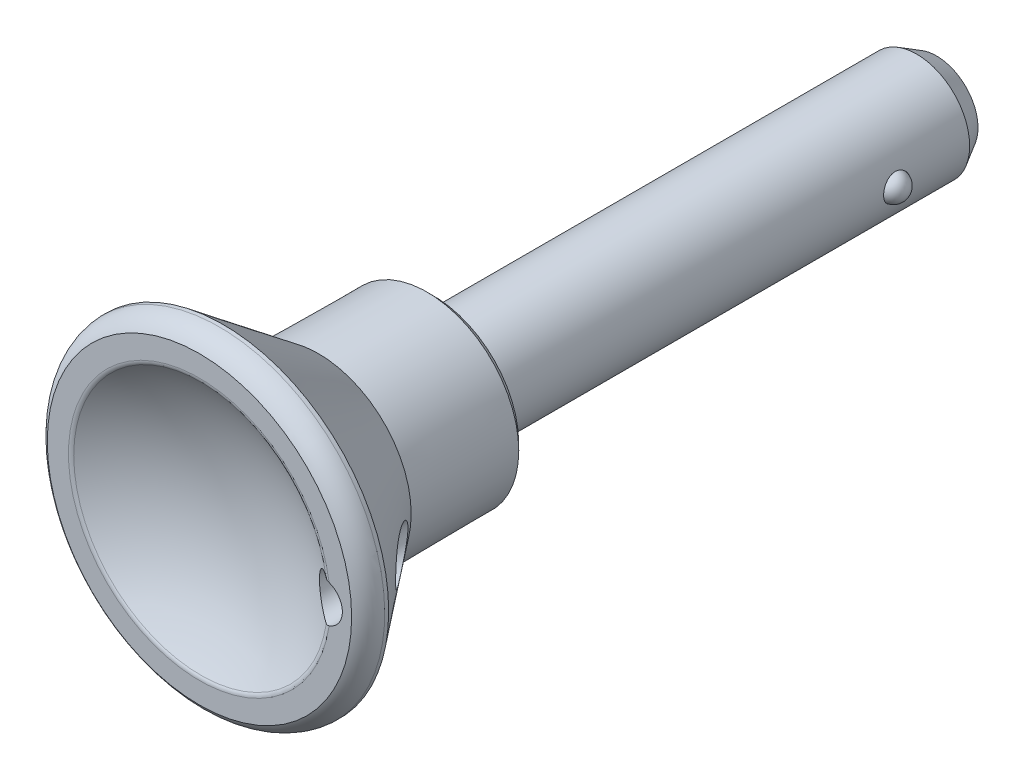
ISO-10303-21;
HEADER;
FILE_DESCRIPTION(('STEP AP214'),'2;1');
FILE_NAME('part.step','',(''),(''),'','','');
FILE_SCHEMA(('AUTOMOTIVE_DESIGN { 1 0 10303 214 1 1 1 1 }'));
ENDSEC;
DATA;
#1=APPLICATION_CONTEXT('core data for automotive mechanical design processes');
#2=APPLICATION_PROTOCOL_DEFINITION('international standard','automotive_design',2000,#1);
#3=PRODUCT_CONTEXT('',#1,'mechanical');
#4=PRODUCT('Part','Part','',(#3));
#5=PRODUCT_RELATED_PRODUCT_CATEGORY('part','',(#4));
#6=PRODUCT_DEFINITION_FORMATION('','',#4);
#7=PRODUCT_DEFINITION_CONTEXT('part definition',#1,'design');
#8=PRODUCT_DEFINITION('design','',#6,#7);
#9=PRODUCT_DEFINITION_SHAPE('','',#8);
#10=(LENGTH_UNIT() NAMED_UNIT(*) SI_UNIT(.MILLI.,.METRE.));
#11=(NAMED_UNIT(*) PLANE_ANGLE_UNIT() SI_UNIT($,.RADIAN.));
#12=(NAMED_UNIT(*) SI_UNIT($,.STERADIAN.) SOLID_ANGLE_UNIT());
#13=UNCERTAINTY_MEASURE_WITH_UNIT(LENGTH_MEASURE(1.E-05),#10,'distance_accuracy_value','');
#14=(GEOMETRIC_REPRESENTATION_CONTEXT(3) GLOBAL_UNCERTAINTY_ASSIGNED_CONTEXT((#13)) GLOBAL_UNIT_ASSIGNED_CONTEXT((#10,
#11,#12)) REPRESENTATION_CONTEXT('',''));
#15=CARTESIAN_POINT('',(0.,0.,0.));
#16=DIRECTION('',(0.,0.,1.));
#17=DIRECTION('',(1.,0.,0.));
#18=AXIS2_PLACEMENT_3D('',#15,#16,#17);
#19=CARTESIAN_POINT('',(0.,0.,0.));
#20=DIRECTION('',(0.,0.,1.));
#21=DIRECTION('',(0.,-1.,0.));
#22=AXIS2_PLACEMENT_3D('',#19,#20,#21);
#23=CYLINDRICAL_SURFACE('',#22,4.);
#24=CARTESIAN_POINT('',(0.,0.,0.));
#25=DIRECTION('',(0.,0.,1.));
#26=DIRECTION('',(0.,-1.,0.));
#27=AXIS2_PLACEMENT_3D('',#24,#25,#26);
#28=CIRCLE('',#27,4.);
#29=CARTESIAN_POINT('',(0.,-4.,0.));
#30=VERTEX_POINT('',#29);
#31=EDGE_CURVE('E17',#30,#30,#28,.T.);
#32=ORIENTED_EDGE('',*,*,#31,.F.);
#33=EDGE_LOOP('',(#32));
#34=FACE_BOUND('',#33,.T.);
#35=CARTESIAN_POINT('',(0.,0.,-36.5));
#36=DIRECTION('',(0.,0.,1.));
#37=DIRECTION('',(1.,0.,0.));
#38=AXIS2_PLACEMENT_3D('',#35,#36,#37);
#39=CIRCLE('',#38,4.);
#40=CARTESIAN_POINT('',(4.,0.,-36.5));
#41=VERTEX_POINT('',#40);
#42=EDGE_CURVE('E111',#41,#41,#39,.T.);
#43=ORIENTED_EDGE('',*,*,#42,.T.);
#44=EDGE_LOOP('',(#43));
#45=FACE_BOUND('',#44,.T.);
#46=CARTESIAN_POINT('',(3.88177455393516,0.965311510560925,-30.7388991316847));
#47=CARTESIAN_POINT('',(3.87947589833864,0.974537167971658,-30.7717537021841));
#48=CARTESIAN_POINT('',(3.87758596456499,0.982015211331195,-30.8051052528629));
#49=CARTESIAN_POINT('',(3.87470673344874,0.993322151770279,-30.8719408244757));
#50=CARTESIAN_POINT('',(3.8737042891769,0.997204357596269,-30.9054152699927));
#51=CARTESIAN_POINT('',(3.87228725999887,1.00270077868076,-30.9925132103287));
#52=CARTESIAN_POINT('',(3.87257020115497,1.00161876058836,-31.0463531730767));
#53=CARTESIAN_POINT('',(3.87471439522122,0.99327385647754,-31.1269570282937));
#54=CARTESIAN_POINT('',(3.87573945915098,0.989279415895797,-31.1541316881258));
#55=CARTESIAN_POINT('',(3.87834788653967,0.979001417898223,-31.2080101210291));
#56=CARTESIAN_POINT('',(3.87993110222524,0.972718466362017,-31.2347140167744));
#57=CARTESIAN_POINT('',(3.88177455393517,0.965311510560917,-31.2611008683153));
#58=B_SPLINE_CURVE_WITH_KNOTS('',3,(#46,#47,#48,#49,#50,#51,#52,#53,#54,#55,#56,#57),
.UNSPECIFIED.,.F.,.F.,(4,2,2,2,2,4),(0.,0.102513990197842,0.20348266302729,0.36412191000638,
0.446491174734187,0.528838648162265),.UNSPECIFIED.);
#59=CARTESIAN_POINT('',(3.88177451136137,0.96531168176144,-30.7388997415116));
#60=VERTEX_POINT('',#59);
#61=CARTESIAN_POINT('',(3.88177446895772,0.965311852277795,-31.2610996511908));
#62=VERTEX_POINT('',#61);
#63=EDGE_CURVE('E69',#60,#62,#58,.T.);
#64=ORIENTED_EDGE('',*,*,#63,.T.);
#65=CARTESIAN_POINT('',(3.88177448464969,0.965311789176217,-31.2610998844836));
#66=CARTESIAN_POINT('',(3.88540385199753,0.950638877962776,-31.3155094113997));
#67=CARTESIAN_POINT('',(3.89014046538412,0.931319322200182,-31.3685420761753));
#68=CARTESIAN_POINT('',(3.90112983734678,0.884199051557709,-31.4704413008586));
#69=CARTESIAN_POINT('',(3.90738045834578,0.856410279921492,-31.5193136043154));
#70=CARTESIAN_POINT('',(3.92071189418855,0.793126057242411,-31.6116284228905));
#71=CARTESIAN_POINT('',(3.92779250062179,0.757632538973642,-31.6550722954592));
#72=CARTESIAN_POINT('',(3.94199278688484,0.67989295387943,-31.7354385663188));
#73=CARTESIAN_POINT('',(3.94911247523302,0.637645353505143,-31.7723594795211));
#74=CARTESIAN_POINT('',(3.96270366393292,0.54690757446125,-31.8391103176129));
#75=CARTESIAN_POINT('',(3.96916547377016,0.498343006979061,-31.8688412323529));
#76=CARTESIAN_POINT('',(3.9806028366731,0.396745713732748,-31.9196822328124));
#77=CARTESIAN_POINT('',(3.98557913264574,0.34371523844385,-31.9407966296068));
#78=CARTESIAN_POINT('',(3.99291972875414,0.242471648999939,-31.9713879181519));
#79=CARTESIAN_POINT('',(3.99555479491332,0.194645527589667,-31.9820925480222));
#80=CARTESIAN_POINT('',(3.99909511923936,0.0978826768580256,-31.9963986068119));
#81=CARTESIAN_POINT('',(4.00000061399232,0.0489461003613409,-32.0000010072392));
#82=CARTESIAN_POINT('',(3.99999930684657,-0.0552566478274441,-31.999998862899));
#83=CARTESIAN_POINT('',(3.99884379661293,-0.110525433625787,-31.9954052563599));
#84=CARTESIAN_POINT('',(3.99434700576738,-0.219475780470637,-31.9771816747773));
#85=CARTESIAN_POINT('',(3.9910047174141,-0.273156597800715,-31.9635475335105));
#86=CARTESIAN_POINT('',(3.98250420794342,-0.377347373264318,-31.9277072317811));
#87=CARTESIAN_POINT('',(3.97734807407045,-0.427860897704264,-31.9055109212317));
#88=CARTESIAN_POINT('',(3.96576893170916,-0.524447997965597,-31.8532124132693));
#89=CARTESIAN_POINT('',(3.95934587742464,-0.570521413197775,-31.8231099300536));
#90=CARTESIAN_POINT('',(3.94578204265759,-0.6578732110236,-31.7551953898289));
#91=CARTESIAN_POINT('',(3.93863012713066,-0.699046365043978,-31.7172502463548));
#92=CARTESIAN_POINT('',(3.92448848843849,-0.774509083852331,-31.6350198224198));
#93=CARTESIAN_POINT('',(3.91749874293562,-0.808799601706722,-31.5907354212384));
#94=CARTESIAN_POINT('',(3.90495270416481,-0.86728421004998,-31.5004846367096));
#95=CARTESIAN_POINT('',(3.8993282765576,-0.892041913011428,-31.4548922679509));
#96=CARTESIAN_POINT('',(3.88941506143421,-0.934286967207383,-31.3602904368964));
#97=CARTESIAN_POINT('',(3.88512710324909,-0.951769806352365,-31.3112788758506));
#98=CARTESIAN_POINT('',(3.88177448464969,-0.965311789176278,-31.2610998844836));
#99=B_SPLINE_CURVE_WITH_KNOTS('',3,(#65,#66,#67,#68,#69,#70,#71,#72,#73,#74,#75,#76,#77,#78,#79,
#80,#81,#82,#83,#84,#85,#86,#87,#88,#89,#90,#91,#92,#93,#94,#95,#96,#97,#98),.UNSPECIFIED.,.F.,
.F.,(4,2,2,2,2,2,2,2,2,2,2,2,2,2,2,2,4),(0.,0.169132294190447,0.338027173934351,
0.506879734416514,0.675770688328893,0.846869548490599,1.01788269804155,1.16458276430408,
1.31126276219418,1.47685399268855,1.6425215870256,1.80799916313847,1.97348272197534,
2.1420468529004,2.31058762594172,2.46651284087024,2.62253462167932),.UNSPECIFIED.);
#100=CARTESIAN_POINT('',(3.88177451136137,-0.965311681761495,-31.2611002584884));
#101=VERTEX_POINT('',#100);
#102=EDGE_CURVE('E55',#62,#101,#99,.T.);
#103=ORIENTED_EDGE('',*,*,#102,.T.);
#104=CARTESIAN_POINT('',(3.88177455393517,-0.96531151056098,-31.2611008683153));
#105=CARTESIAN_POINT('',(3.87947589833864,-0.974537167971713,-31.2282462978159));
#106=CARTESIAN_POINT('',(3.87758596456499,-0.982015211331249,-31.1948947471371));
#107=CARTESIAN_POINT('',(3.87470673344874,-0.993322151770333,-31.1280591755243));
#108=CARTESIAN_POINT('',(3.8737042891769,-0.997204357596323,-31.0945847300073));
#109=CARTESIAN_POINT('',(3.87228725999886,-1.00270077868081,-31.0074867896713));
#110=CARTESIAN_POINT('',(3.87257020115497,-1.00161876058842,-30.9536468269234));
#111=CARTESIAN_POINT('',(3.87471439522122,-0.993273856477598,-30.8730429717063));
#112=CARTESIAN_POINT('',(3.87573945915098,-0.989279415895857,-30.8458683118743));
#113=CARTESIAN_POINT('',(3.87834788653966,-0.979001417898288,-30.791989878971));
#114=CARTESIAN_POINT('',(3.87993110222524,-0.972718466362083,-30.7652859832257));
#115=CARTESIAN_POINT('',(3.88177455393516,-0.965311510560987,-30.7388991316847));
#116=B_SPLINE_CURVE_WITH_KNOTS('',3,(#104,#105,#106,#107,#108,#109,#110,#111,#112,#113,#114,
#115),.UNSPECIFIED.,.F.,.F.,(4,2,2,2,2,4),(0.,0.102513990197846,0.203482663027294,
0.36412191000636,0.446491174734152,0.528838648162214),.UNSPECIFIED.);
#117=CARTESIAN_POINT('',(3.88177446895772,-0.965311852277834,-30.7389003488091));
#118=VERTEX_POINT('',#117);
#119=EDGE_CURVE('E62',#101,#118,#116,.T.);
#120=ORIENTED_EDGE('',*,*,#119,.T.);
#121=CARTESIAN_POINT('',(3.88177448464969,-0.965311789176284,-30.7389001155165));
#122=CARTESIAN_POINT('',(3.88540385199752,-0.950638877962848,-30.6844905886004));
#123=CARTESIAN_POINT('',(3.89014046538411,-0.931319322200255,-30.6314579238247));
#124=CARTESIAN_POINT('',(3.90112983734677,-0.884199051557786,-30.5295586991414));
#125=CARTESIAN_POINT('',(3.90738045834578,-0.856410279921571,-30.4806863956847));
#126=CARTESIAN_POINT('',(3.92071189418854,-0.7931260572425,-30.3883715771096));
#127=CARTESIAN_POINT('',(3.92779250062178,-0.757632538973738,-30.3449277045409));
#128=CARTESIAN_POINT('',(3.94199278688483,-0.679892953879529,-30.2645614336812));
#129=CARTESIAN_POINT('',(3.94911247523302,-0.637645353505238,-30.2276405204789));
#130=CARTESIAN_POINT('',(3.96270366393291,-0.546907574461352,-30.1608896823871));
#131=CARTESIAN_POINT('',(3.96916547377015,-0.498343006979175,-30.1311587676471));
#132=CARTESIAN_POINT('',(3.98060283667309,-0.396745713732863,-30.0803177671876));
#133=CARTESIAN_POINT('',(3.98557913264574,-0.343715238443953,-30.0592033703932));
#134=CARTESIAN_POINT('',(3.99291972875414,-0.242471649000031,-30.0286120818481));
#135=CARTESIAN_POINT('',(3.99555479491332,-0.194645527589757,-30.0179074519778));
#136=CARTESIAN_POINT('',(3.99909511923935,-0.097882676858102,-30.0036013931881));
#137=CARTESIAN_POINT('',(4.00000061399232,-0.0489461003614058,-29.9999989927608));
#138=CARTESIAN_POINT('',(3.99999930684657,0.0552566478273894,-30.000001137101));
#139=CARTESIAN_POINT('',(3.99884379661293,0.110525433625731,-30.0045947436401));
#140=CARTESIAN_POINT('',(3.99434700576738,0.21947578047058,-30.0228183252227));
#141=CARTESIAN_POINT('',(3.9910047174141,0.273156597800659,-30.0364524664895));
#142=CARTESIAN_POINT('',(3.98250420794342,0.377347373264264,-30.0722927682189));
#143=CARTESIAN_POINT('',(3.97734807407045,0.42786089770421,-30.0944890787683));
#144=CARTESIAN_POINT('',(3.96576893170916,0.524447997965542,-30.1467875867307));
#145=CARTESIAN_POINT('',(3.95934587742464,0.570521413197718,-30.1768900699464));
#146=CARTESIAN_POINT('',(3.94578204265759,0.657873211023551,-30.2448046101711));
#147=CARTESIAN_POINT('',(3.93863012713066,0.699046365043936,-30.2827497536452));
#148=CARTESIAN_POINT('',(3.92448848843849,0.774509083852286,-30.3649801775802));
#149=CARTESIAN_POINT('',(3.91749874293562,0.808799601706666,-30.4092645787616));
#150=CARTESIAN_POINT('',(3.90495270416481,0.867284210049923,-30.4995153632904));
#151=CARTESIAN_POINT('',(3.8993282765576,0.892041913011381,-30.5451077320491));
#152=CARTESIAN_POINT('',(3.8894150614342,0.934286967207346,-30.6397095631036));
#153=CARTESIAN_POINT('',(3.88512710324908,0.951769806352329,-30.6887211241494));
#154=CARTESIAN_POINT('',(3.88177448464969,0.965311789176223,-30.7389001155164));
#155=B_SPLINE_CURVE_WITH_KNOTS('',3,(#121,#122,#123,#124,#125,#126,#127,#128,#129,#130,#131,
#132,#133,#134,#135,#136,#137,#138,#139,#140,#141,#142,#143,#144,#145,#146,#147,#148,#149,#150,
#151,#152,#153,#154),.UNSPECIFIED.,.F.,.F.,(4,2,2,2,2,2,2,2,2,2,2,2,2,2,2,2,4),(0.,
0.169132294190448,0.338027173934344,0.506879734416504,0.675770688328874,0.84686954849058,
1.01788269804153,1.16458276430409,1.31126276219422,1.47685399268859,1.64252158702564,
1.80799916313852,1.97348272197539,2.14204685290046,2.3105876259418,2.46651284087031,
2.62253462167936),.UNSPECIFIED.);
#156=EDGE_CURVE('E67',#118,#60,#155,.T.);
#157=ORIENTED_EDGE('',*,*,#156,.T.);
#158=EDGE_LOOP('',(#64,#103,#120,#157));
#159=FACE_BOUND('',#158,.T.);
#160=ADVANCED_FACE('F14',(#34,#45,#159),#23,.T.);
#161=CARTESIAN_POINT('',(6.4240762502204,-6.50116727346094,0.));
#162=DIRECTION('',(0.,0.,-1.));
#163=DIRECTION('',(-1.,0.,0.));
#164=AXIS2_PLACEMENT_3D('',#161,#162,#163);
#165=PLANE('',#164);
#166=ORIENTED_EDGE('',*,*,#31,.T.);
#167=EDGE_LOOP('',(#166));
#168=FACE_BOUND('',#167,.T.);
#169=CARTESIAN_POINT('',(0.,0.,0.));
#170=DIRECTION('',(0.,0.,1.));
#171=DIRECTION('',(0.,-1.,0.));
#172=AXIS2_PLACEMENT_3D('',#169,#170,#171);
#173=CIRCLE('',#172,6.4240762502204);
#174=CARTESIAN_POINT('',(0.,-6.4240762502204,0.));
#175=VERTEX_POINT('',#174);
#176=EDGE_CURVE('E186',#175,#175,#173,.T.);
#177=ORIENTED_EDGE('',*,*,#176,.F.);
#178=EDGE_LOOP('',(#177));
#179=FACE_BOUND('',#178,.T.);
#180=ADVANCED_FACE('F205',(#168,#179),#165,.T.);
#181=CARTESIAN_POINT('',(0.,0.,0.));
#182=DIRECTION('',(0.,0.,1.));
#183=DIRECTION('',(0.,-1.,0.));
#184=AXIS2_PLACEMENT_3D('',#181,#182,#183);
#185=CONICAL_SURFACE('',#184,6.4240762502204,0.789761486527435);
#186=CARTESIAN_POINT('',(0.,0.,0.499980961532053));
#187=DIRECTION('',(0.,0.,-1.));
#188=DIRECTION('',(1.,0.,0.));
#189=AXIS2_PLACEMENT_3D('',#186,#187,#188);
#190=CIRCLE('',#189,6.92843951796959);
#191=CARTESIAN_POINT('',(6.92843951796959,0.,0.499980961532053));
#192=VERTEX_POINT('',#191);
#193=EDGE_CURVE('E182',#192,#192,#190,.F.);
#194=ORIENTED_EDGE('',*,*,#193,.F.);
#195=EDGE_LOOP('',(#194));
#196=FACE_BOUND('',#195,.T.);
#197=ORIENTED_EDGE('',*,*,#176,.T.);
#198=EDGE_LOOP('',(#197));
#199=FACE_BOUND('',#198,.T.);
#200=ADVANCED_FACE('F210',(#196,#199),#185,.T.);
#201=CARTESIAN_POINT('',(0.,0.,0.499980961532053));
#202=DIRECTION('',(0.,0.,1.));
#203=DIRECTION('',(0.,-1.,0.));
#204=AXIS2_PLACEMENT_3D('',#201,#202,#203);
#205=CONICAL_SURFACE('',#204,6.92843951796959,0.00872664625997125);
#206=CARTESIAN_POINT('',(0.,0.,8.7));
#207=DIRECTION('',(0.,0.,-1.));
#208=DIRECTION('',(1.,0.,0.));
#209=AXIS2_PLACEMENT_3D('',#206,#207,#208);
#210=CIRCLE('',#209,7.);
#211=CARTESIAN_POINT('',(7.,0.,8.7));
#212=VERTEX_POINT('',#211);
#213=EDGE_CURVE('E178',#212,#212,#210,.F.);
#214=ORIENTED_EDGE('',*,*,#213,.F.);
#215=EDGE_LOOP('',(#214));
#216=FACE_BOUND('',#215,.T.);
#217=ORIENTED_EDGE('',*,*,#193,.T.);
#218=EDGE_LOOP('',(#217));
#219=FACE_BOUND('',#218,.T.);
#220=ADVANCED_FACE('F279',(#216,#219),#205,.T.);
#221=CARTESIAN_POINT('',(0.,0.,16.2));
#222=DIRECTION('',(0.,0.,1.));
#223=DIRECTION('',(0.,-1.,0.));
#224=AXIS2_PLACEMENT_3D('',#221,#222,#223);
#225=CYLINDRICAL_SURFACE('',#224,12.5);
#226=CARTESIAN_POINT('',(0.,0.,15.9));
#227=DIRECTION('',(0.,0.,-1.));
#228=DIRECTION('',(1.,0.,0.));
#229=AXIS2_PLACEMENT_3D('',#226,#227,#228);
#230=CIRCLE('',#229,12.5);
#231=CARTESIAN_POINT('',(12.5,0.,15.9));
#232=VERTEX_POINT('',#231);
#233=EDGE_CURVE('E179',#232,#232,#230,.T.);
#234=ORIENTED_EDGE('',*,*,#233,.F.);
#235=EDGE_LOOP('',(#234));
#236=FACE_BOUND('',#235,.T.);
#237=CARTESIAN_POINT('',(0.,0.,16.2));
#238=DIRECTION('',(0.,0.,1.));
#239=DIRECTION('',(0.,-1.,0.));
#240=AXIS2_PLACEMENT_3D('',#237,#238,#239);
#241=CIRCLE('',#240,12.5);
#242=CARTESIAN_POINT('',(0.,-12.5,16.2));
#243=VERTEX_POINT('',#242);
#244=EDGE_CURVE('E175',#243,#243,#241,.T.);
#245=ORIENTED_EDGE('',*,*,#244,.F.);
#246=EDGE_LOOP('',(#245));
#247=FACE_BOUND('',#246,.T.);
#248=ADVANCED_FACE('F270',(#236,#247),#225,.T.);
#249=CARTESIAN_POINT('',(0.,0.,8.7));
#250=DIRECTION('',(0.,0.,1.));
#251=DIRECTION('',(0.,-1.,0.));
#252=AXIS2_PLACEMENT_3D('',#249,#250,#251);
#253=CONICAL_SURFACE('',#252,7.,0.65233090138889);
#254=CARTESIAN_POINT('',(9.05806451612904,-1.48036050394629,11.5515077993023));
#255=CARTESIAN_POINT('',(8.99141512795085,-1.46946825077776,11.4631001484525));
#256=CARTESIAN_POINT('',(8.92550148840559,-1.45408557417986,11.3746905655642));
#257=CARTESIAN_POINT('',(8.7955636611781,-1.41427171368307,11.1984472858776));
#258=CARTESIAN_POINT('',(8.73154031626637,-1.38983655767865,11.1106138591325));
#259=CARTESIAN_POINT('',(8.60623315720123,-1.33170423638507,10.936758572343));
#260=CARTESIAN_POINT('',(8.54493725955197,-1.29805393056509,10.8507298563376));
#261=CARTESIAN_POINT('',(8.42544336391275,-1.22074353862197,10.6811358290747));
#262=CARTESIAN_POINT('',(8.36724184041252,-1.17709515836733,10.5975677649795));
#263=CARTESIAN_POINT('',(8.26922940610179,-1.09114708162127,10.4552980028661));
#264=CARTESIAN_POINT('',(8.22852162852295,-1.05135683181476,10.3957022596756));
#265=CARTESIAN_POINT('',(8.14989980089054,-0.964725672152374,10.2796936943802));
#266=CARTESIAN_POINT('',(8.11198828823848,-0.917878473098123,10.2232837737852));
#267=CARTESIAN_POINT('',(8.03963417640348,-0.81574430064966,10.1148327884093));
#268=CARTESIAN_POINT('',(8.00522654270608,-0.760383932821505,10.0628364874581));
#269=CARTESIAN_POINT('',(7.94192848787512,-0.640477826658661,9.96655825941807));
#270=CARTESIAN_POINT('',(7.91302454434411,-0.575955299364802,9.92225744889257));
#271=CARTESIAN_POINT('',(7.87251252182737,-0.463057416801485,9.85986137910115));
#272=CARTESIAN_POINT('',(7.85846623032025,-0.417573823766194,9.8381417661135));
#273=CARTESIAN_POINT('',(7.83441768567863,-0.3231529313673,9.80086955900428));
#274=CARTESIAN_POINT('',(7.82440740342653,-0.274222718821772,9.78530472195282));
#275=CARTESIAN_POINT('',(7.81132335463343,-0.187620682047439,9.76493500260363));
#276=CARTESIAN_POINT('',(7.80710048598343,-0.15053785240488,9.7583503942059));
#277=CARTESIAN_POINT('',(7.80143783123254,-0.0756412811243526,9.74951765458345));
#278=CARTESIAN_POINT('',(7.79999798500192,-0.0378275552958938,9.74726942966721));
#279=CARTESIAN_POINT('',(7.8000025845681,0.0485200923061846,9.74727695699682));
#280=CARTESIAN_POINT('',(7.80237736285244,0.0970629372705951,9.75098545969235));
#281=CARTESIAN_POINT('',(7.81164444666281,0.192651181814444,9.76543406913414));
#282=CARTESIAN_POINT('',(7.81854204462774,0.239694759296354,9.77618241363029));
#283=CARTESIAN_POINT('',(7.83829683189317,0.341610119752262,9.80688772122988));
#284=CARTESIAN_POINT('',(7.85215507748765,0.395817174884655,9.82838678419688));
#285=CARTESIAN_POINT('',(7.8845198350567,0.499375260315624,9.87838349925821));
#286=CARTESIAN_POINT('',(7.90303499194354,0.548717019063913,9.9068941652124));
#287=CARTESIAN_POINT('',(7.95423062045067,0.667068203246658,9.98533549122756));
#288=CARTESIAN_POINT('',(7.98924354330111,0.732796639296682,10.0386516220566));
#289=CARTESIAN_POINT('',(8.06472209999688,0.853932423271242,10.1525776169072));
#290=CARTESIAN_POINT('',(8.10520064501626,0.909314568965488,10.2132047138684));
#291=CARTESIAN_POINT('',(8.18383548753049,1.00367842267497,10.3298982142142));
#292=CARTESIAN_POINT('',(8.22147534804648,1.04387385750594,10.3853483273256));
#293=CARTESIAN_POINT('',(8.29898008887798,1.1184153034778,10.4986148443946));
#294=CARTESIAN_POINT('',(8.33884646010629,1.15275733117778,10.556432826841));
#295=CARTESIAN_POINT('',(8.42042546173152,1.21614962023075,10.6737908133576));
#296=CARTESIAN_POINT('',(8.46214099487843,1.24519116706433,10.7333334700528));
#297=CARTESIAN_POINT('',(8.54706483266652,1.29830522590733,10.8535675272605));
#298=CARTESIAN_POINT('',(8.59027353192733,1.32237641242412,10.9142592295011));
#299=CARTESIAN_POINT('',(8.69675324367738,1.37513054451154,11.0626135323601));
#300=CARTESIAN_POINT('',(8.7606819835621,1.40136483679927,11.150681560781));
#301=CARTESIAN_POINT('',(8.89058399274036,1.4446681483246,11.3275915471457));
#302=CARTESIAN_POINT('',(8.95655819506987,1.46173291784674,11.4164338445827));
#303=CARTESIAN_POINT('',(9.09008194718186,1.48679092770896,11.5942301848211));
#304=CARTESIAN_POINT('',(9.15763151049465,1.49478409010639,11.683184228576));
#305=CARTESIAN_POINT('',(9.293788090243,1.50153429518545,11.8605390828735));
#306=CARTESIAN_POINT('',(9.36239469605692,1.50029483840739,11.9489400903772));
#307=CARTESIAN_POINT('',(9.53896432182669,1.48478544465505,12.1740527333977));
#308=CARTESIAN_POINT('',(9.64741582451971,1.46359594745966,12.3100469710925));
#309=CARTESIAN_POINT('',(9.80896256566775,1.41213790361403,12.5095339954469));
#310=CARTESIAN_POINT('',(9.86259038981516,1.39172486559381,12.5752398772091));
#311=CARTESIAN_POINT('',(9.96902195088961,1.34380635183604,12.7046889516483));
#312=CARTESIAN_POINT('',(10.021826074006,1.31630431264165,12.7684330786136));
#313=CARTESIAN_POINT('',(10.1398540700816,1.2452226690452,12.9099256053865));
#314=CARTESIAN_POINT('',(10.2046458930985,1.19931241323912,12.9868895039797));
#315=CARTESIAN_POINT('',(10.3299573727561,1.09357010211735,13.1345591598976));
#316=CARTESIAN_POINT('',(10.3904821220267,1.03375502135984,13.2052724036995));
#317=CARTESIAN_POINT('',(10.4895745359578,0.916081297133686,13.3202576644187));
#318=CARTESIAN_POINT('',(10.5297805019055,0.861692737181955,13.3666468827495));
#319=CARTESIAN_POINT('',(10.6043536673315,0.743973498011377,13.452316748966));
#320=CARTESIAN_POINT('',(10.6387288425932,0.680655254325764,13.4916071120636));
#321=CARTESIAN_POINT('',(10.6925693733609,0.560424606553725,13.5529446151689));
#322=CARTESIAN_POINT('',(10.7136506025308,0.505208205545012,13.5768833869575));
#323=CARTESIAN_POINT('',(10.7495749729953,0.390302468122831,13.6176027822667));
#324=CARTESIAN_POINT('',(10.7644289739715,0.330621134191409,13.6343958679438));
#325=CARTESIAN_POINT('',(10.7836092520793,0.225596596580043,13.656059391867));
#326=CARTESIAN_POINT('',(10.7897268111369,0.180990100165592,13.6629607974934));
#327=CARTESIAN_POINT('',(10.7979243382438,0.0909301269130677,13.6722061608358));
#328=CARTESIAN_POINT('',(10.8000037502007,0.0454765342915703,13.6745494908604));
#329=CARTESIAN_POINT('',(10.799994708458,-0.0641674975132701,13.6745397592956));
#330=CARTESIAN_POINT('',(10.795841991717,-0.128380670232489,13.6698606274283));
#331=CARTESIAN_POINT('',(10.7796239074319,-0.254506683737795,13.6515601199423));
#332=CARTESIAN_POINT('',(10.7675483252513,-0.316416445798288,13.6379272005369));
#333=CARTESIAN_POINT('',(10.7366563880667,-0.435644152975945,13.6029693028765));
#334=CARTESIAN_POINT('',(10.7178919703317,-0.492993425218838,13.5817035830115));
#335=CARTESIAN_POINT('',(10.6748799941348,-0.602645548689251,13.5328118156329));
#336=CARTESIAN_POINT('',(10.6506301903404,-0.654946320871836,13.5051831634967));
#337=CARTESIAN_POINT('',(10.5859735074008,-0.776472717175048,13.431253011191));
#338=CARTESIAN_POINT('',(10.5432056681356,-0.842728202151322,13.3821425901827));
#339=CARTESIAN_POINT('',(10.4516580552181,-0.964099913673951,13.2763616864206));
#340=CARTESIAN_POINT('',(10.4028645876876,-1.01918998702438,13.2196739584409));
#341=CARTESIAN_POINT('',(10.2766029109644,-1.14345503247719,13.0719673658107));
#342=CARTESIAN_POINT('',(10.1967753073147,-1.20635475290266,12.9777102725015));
#343=CARTESIAN_POINT('',(10.0329696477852,-1.31236147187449,12.7820645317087));
#344=CARTESIAN_POINT('',(9.94898466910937,-1.35543413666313,12.6806638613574));
#345=CARTESIAN_POINT('',(9.79718248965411,-1.41705079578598,12.4951419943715));
#346=CARTESIAN_POINT('',(9.72964852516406,-1.43883766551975,12.4118303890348));
#347=CARTESIAN_POINT('',(9.59439459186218,-1.47247845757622,12.2433068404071));
#348=CARTESIAN_POINT('',(9.52667453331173,-1.48432617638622,12.1580937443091));
#349=CARTESIAN_POINT('',(9.39151350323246,-1.49875216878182,11.9862568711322));
#350=CARTESIAN_POINT('',(9.32407407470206,-1.50130123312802,11.8996295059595));
#351=CARTESIAN_POINT('',(9.19020636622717,-1.49747387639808,11.725837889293));
#352=CARTESIAN_POINT('',(9.12377782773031,-1.49109977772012,11.6386737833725));
#353=CARTESIAN_POINT('',(9.05806451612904,-1.48036050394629,11.5515077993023));
#354=B_SPLINE_CURVE_WITH_KNOTS('',3,(#254,#255,#256,#257,#258,#259,#260,#261,#262,#263,#264,
#265,#266,#267,#268,#269,#270,#271,#272,#273,#274,#275,#276,#277,#278,#279,#280,#281,#282,#283,
#284,#285,#286,#287,#288,#289,#290,#291,#292,#293,#294,#295,#296,#297,#298,#299,#300,#301,#302,
#303,#304,#305,#306,#307,#308,#309,#310,#311,#312,#313,#314,#315,#316,#317,#318,#319,#320,#321,
#322,#323,#324,#325,#326,#327,#328,#329,#330,#331,#332,#333,#334,#335,#336,#337,#338,#339,#340,
#341,#342,#343,#344,#345,#346,#347,#348,#349,#350,#351,#352,#353),.UNSPECIFIED.,.T.,.F.,(4,2,2,
2,2,2,2,2,2,2,2,2,2,2,2,2,2,2,2,2,2,2,2,2,2,2,2,2,2,2,2,2,2,2,2,2,2,2,2,2,2,2,2,2,2,2,2,2,2,4),
(0.,0.333658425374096,0.667463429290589,0.999601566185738,1.33135280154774,1.57826788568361,
1.82540433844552,2.07480511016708,2.32358497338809,2.48005639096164,2.63621497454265,
2.74958301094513,2.86294859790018,3.00835870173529,3.15393926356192,3.33275537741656,
3.51190592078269,3.78514778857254,4.05904679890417,4.2931693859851,4.52745067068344,
4.76211373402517,4.9968392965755,5.33221840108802,5.66775280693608,6.0032900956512,
6.33870017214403,6.86226215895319,7.12372139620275,7.38505412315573,7.71589293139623,
8.04632996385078,8.29159071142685,8.53651321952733,8.72709088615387,8.91733480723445,
9.05359735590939,9.18987866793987,9.38217192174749,9.57471358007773,9.76579164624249,
9.9569480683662,10.2340958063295,10.5118854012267,10.9254412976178,11.3397106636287,
11.6675345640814,11.995562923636,12.3246208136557,12.6535930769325),.UNSPECIFIED.);
#355=CARTESIAN_POINT('',(9.05806451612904,-1.48036050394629,11.5515077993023));
#356=VERTEX_POINT('',#355);
#357=EDGE_CURVE('E145',#356,#356,#354,.T.);
#358=ORIENTED_EDGE('',*,*,#357,.F.);
#359=EDGE_LOOP('',(#358));
#360=FACE_BOUND('',#359,.T.);
#361=ORIENTED_EDGE('',*,*,#233,.T.);
#362=EDGE_LOOP('',(#361));
#363=FACE_BOUND('',#362,.T.);
#364=ORIENTED_EDGE('',*,*,#213,.T.);
#365=EDGE_LOOP('',(#364));
#366=FACE_BOUND('',#365,.T.);
#367=ADVANCED_FACE('F168',(#360,#363,#366),#253,.T.);
#368=CARTESIAN_POINT('',(0.,0.,15.9596620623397));
#369=DIRECTION('',(0.,0.,1.));
#370=DIRECTION('',(0.,-1.,0.));
#371=AXIS2_PLACEMENT_3D('',#368,#369,#370);
#372=TOROIDAL_SURFACE('',#371,10.5144930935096,2.);
#373=ORIENTED_EDGE('',*,*,#244,.T.);
#374=EDGE_LOOP('',(#373));
#375=FACE_BOUND('',#374,.T.);
#376=CARTESIAN_POINT('',(0.,0.,17.7));
#377=DIRECTION('',(0.,0.,1.));
#378=DIRECTION('',(0.,-1.,0.));
#379=AXIS2_PLACEMENT_3D('',#376,#377,#378);
#380=CIRCLE('',#379,11.5);
#381=CARTESIAN_POINT('',(0.,-11.5,17.7));
#382=VERTEX_POINT('',#381);
#383=EDGE_CURVE('E190',#382,#382,#380,.T.);
#384=ORIENTED_EDGE('',*,*,#383,.F.);
#385=EDGE_LOOP('',(#384));
#386=FACE_BOUND('',#385,.T.);
#387=ADVANCED_FACE('F160',(#375,#386),#372,.T.);
#388=CARTESIAN_POINT('',(9.3,0.,9.7468824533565));
#389=DIRECTION('',(0.,0.,1.));
#390=DIRECTION('',(0.,-1.,0.));
#391=AXIS2_PLACEMENT_3D('',#388,#389,#390);
#392=CYLINDRICAL_SURFACE('',#391,1.5);
#393=ORIENTED_EDGE('',*,*,#357,.T.);
#394=EDGE_LOOP('',(#393));
#395=FACE_BOUND('',#394,.T.);
#396=CARTESIAN_POINT('',(9.79838709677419,-1.41478277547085,17.7));
#397=CARTESIAN_POINT('',(9.76967463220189,-1.42493393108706,17.7000278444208));
#398=CARTESIAN_POINT('',(9.74057958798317,-1.43416331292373,17.6978154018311));
#399=CARTESIAN_POINT('',(9.68339626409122,-1.45046247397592,17.688811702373));
#400=CARTESIAN_POINT('',(9.65530246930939,-1.45758512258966,17.6821493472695));
#401=CARTESIAN_POINT('',(9.60265119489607,-1.46937623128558,17.6649718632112));
#402=CARTESIAN_POINT('',(9.5780018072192,-1.47420693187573,17.6548534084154));
#403=CARTESIAN_POINT('',(9.52973678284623,-1.48251466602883,17.6305344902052));
#404=CARTESIAN_POINT('',(9.50616459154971,-1.48595330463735,17.6162348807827));
#405=CARTESIAN_POINT('',(9.48387096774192,-1.48868783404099,17.6));
#406=B_SPLINE_CURVE_WITH_KNOTS('',3,(#396,#397,#398,#399,#400,#401,#402,#403,#404,#405),
.UNSPECIFIED.,.F.,.F.,(4,2,2,2,4),(0.,0.0913475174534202,0.180157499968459,0.261045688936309,
0.344033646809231),.UNSPECIFIED.);
#407=CARTESIAN_POINT('',(9.79838709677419,-1.41478277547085,17.7));
#408=VERTEX_POINT('',#407);
#409=CARTESIAN_POINT('',(9.48387096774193,-1.48868783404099,17.6));
#410=VERTEX_POINT('',#409);
#411=EDGE_CURVE('E137',#408,#410,#406,.T.);
#412=ORIENTED_EDGE('',*,*,#411,.F.);
#413=CARTESIAN_POINT('',(9.3,0.,17.7));
#414=DIRECTION('',(0.,0.,1.));
#415=DIRECTION('',(0.,-1.,0.));
#416=AXIS2_PLACEMENT_3D('',#413,#414,#415);
#417=CIRCLE('',#416,1.5);
#418=CARTESIAN_POINT('',(9.79838709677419,1.41478277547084,17.7));
#419=VERTEX_POINT('',#418);
#420=EDGE_CURVE('E30',#419,#408,#417,.F.);
#421=ORIENTED_EDGE('',*,*,#420,.F.);
#422=CARTESIAN_POINT('',(9.79838709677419,1.41478277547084,17.7));
#423=CARTESIAN_POINT('',(9.76967463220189,1.42493393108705,17.7000278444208));
#424=CARTESIAN_POINT('',(9.74057958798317,1.43416331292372,17.6978154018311));
#425=CARTESIAN_POINT('',(9.68339626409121,1.45046247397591,17.688811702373));
#426=CARTESIAN_POINT('',(9.65530246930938,1.45758512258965,17.6821493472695));
#427=CARTESIAN_POINT('',(9.60265119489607,1.46937623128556,17.6649718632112));
#428=CARTESIAN_POINT('',(9.57800180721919,1.47420693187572,17.6548534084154));
#429=CARTESIAN_POINT('',(9.52973678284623,1.48251466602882,17.6305344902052));
#430=CARTESIAN_POINT('',(9.50616459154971,1.48595330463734,17.6162348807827));
#431=CARTESIAN_POINT('',(9.48387096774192,1.48868783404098,17.6));
#432=B_SPLINE_CURVE_WITH_KNOTS('',3,(#422,#423,#424,#425,#426,#427,#428,#429,#430,#431),
.UNSPECIFIED.,.F.,.F.,(4,2,2,2,4),(0.,0.0913475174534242,0.180157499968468,0.261045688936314,
0.344033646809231),.UNSPECIFIED.);
#433=CARTESIAN_POINT('',(9.48387096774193,1.48868783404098,17.6));
#434=VERTEX_POINT('',#433);
#435=EDGE_CURVE('E129',#419,#434,#432,.T.);
#436=ORIENTED_EDGE('',*,*,#435,.T.);
#437=CARTESIAN_POINT('',(9.48387096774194,-1.48868783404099,17.6));
#438=CARTESIAN_POINT('',(9.38181447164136,-1.5012604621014,17.5258231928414));
#439=CARTESIAN_POINT('',(9.27847034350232,-1.50339409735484,17.4514075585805));
#440=CARTESIAN_POINT('',(9.07150168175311,-1.48616897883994,17.3036113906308));
#441=CARTESIAN_POINT('',(8.96788247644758,-1.46662385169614,17.230245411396));
#442=CARTESIAN_POINT('',(8.76570217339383,-1.40554015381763,17.0882393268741));
#443=CARTESIAN_POINT('',(8.66709675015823,-1.36425592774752,17.0195547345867));
#444=CARTESIAN_POINT('',(8.47807170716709,-1.25938003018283,16.8888158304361));
#445=CARTESIAN_POINT('',(8.38761877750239,-1.19588484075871,16.8267343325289));
#446=CARTESIAN_POINT('',(8.24568836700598,-1.0697955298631,16.7298945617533));
#447=CARTESIAN_POINT('',(8.19079097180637,-1.01295594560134,16.692612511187));
#448=CARTESIAN_POINT('',(8.08925811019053,-0.889102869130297,16.6238983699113));
#449=CARTESIAN_POINT('',(8.04262373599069,-0.822088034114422,16.5924670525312));
#450=CARTESIAN_POINT('',(7.95961243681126,-0.678453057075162,16.5366671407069));
#451=CARTESIAN_POINT('',(7.9233211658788,-0.601759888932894,16.5123574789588));
#452=CARTESIAN_POINT('',(7.86387797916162,-0.441385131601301,16.4726071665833));
#453=CARTESIAN_POINT('',(7.84069382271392,-0.357721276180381,16.4571447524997));
#454=CARTESIAN_POINT('',(7.81665644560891,-0.227526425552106,16.4411240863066));
#455=CARTESIAN_POINT('',(7.81042627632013,-0.182354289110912,16.4369745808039));
#456=CARTESIAN_POINT('',(7.80209606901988,-0.091465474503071,16.4314273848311));
#457=CARTESIAN_POINT('',(7.79999581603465,-0.0457488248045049,16.4300295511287));
#458=CARTESIAN_POINT('',(7.8000067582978,0.0738974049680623,16.4300365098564));
#459=CARTESIAN_POINT('',(7.80550430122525,0.147878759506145,16.4336949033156));
#460=CARTESIAN_POINT('',(7.82172596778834,0.257047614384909,16.4445026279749));
#461=CARTESIAN_POINT('',(7.82847272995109,0.293170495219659,16.4489987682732));
#462=CARTESIAN_POINT('',(7.84452794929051,0.364609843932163,16.4597055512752));
#463=CARTESIAN_POINT('',(7.85383787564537,0.399925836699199,16.4659171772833));
#464=CARTESIAN_POINT('',(7.88533418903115,0.503926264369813,16.4869492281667));
#465=CARTESIAN_POINT('',(7.91114789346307,0.571060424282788,16.5042071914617));
#466=CARTESIAN_POINT('',(7.97122958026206,0.699580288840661,16.5444764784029));
#467=CARTESIAN_POINT('',(8.00550445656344,0.760961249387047,16.5674924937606));
#468=CARTESIAN_POINT('',(8.06330229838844,0.849663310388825,16.6064232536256));
#469=CARTESIAN_POINT('',(8.08431449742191,0.879441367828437,16.6205962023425));
#470=CARTESIAN_POINT('',(8.12808579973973,0.936974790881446,16.6501700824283));
#471=CARTESIAN_POINT('',(8.15084283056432,0.964732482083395,16.6655695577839));
#472=CARTESIAN_POINT('',(8.22150377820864,1.04495101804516,16.7134720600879));
#473=CARTESIAN_POINT('',(8.27178709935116,1.09434151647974,16.7476721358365));
#474=CARTESIAN_POINT('',(8.38550726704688,1.19170689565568,16.8253434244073));
#475=CARTESIAN_POINT('',(8.44976642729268,1.2382209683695,16.8694253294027));
#476=CARTESIAN_POINT('',(8.58287694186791,1.31978473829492,16.961227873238));
#477=CARTESIAN_POINT('',(8.65173257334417,1.3548235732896,17.0089519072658));
#478=CARTESIAN_POINT('',(8.76337185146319,1.40144242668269,17.0867690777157));
#479=CARTESIAN_POINT('',(8.80522580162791,1.41674274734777,17.1160369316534));
#480=CARTESIAN_POINT('',(8.88962205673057,1.44344948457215,17.1752539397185));
#481=CARTESIAN_POINT('',(8.93216367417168,1.45485956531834,17.2052024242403));
#482=CARTESIAN_POINT('',(9.06048356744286,1.4833442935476,17.2958544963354));
#483=CARTESIAN_POINT('',(9.14699642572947,1.4946896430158,17.3573922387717));
#484=CARTESIAN_POINT('',(9.31725275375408,1.50223877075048,17.4793658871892));
#485=CARTESIAN_POINT('',(9.40099551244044,1.49891929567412,17.5397732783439));
#486=CARTESIAN_POINT('',(9.48387096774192,1.4886878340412,17.6));
#487=B_SPLINE_CURVE_WITH_KNOTS('',3,(#437,#438,#439,#440,#441,#442,#443,#444,#445,#446,#447,
#448,#449,#450,#451,#452,#453,#454,#455,#456,#457,#458,#459,#460,#461,#462,#463,#464,#465,#466,
#467,#468,#469,#470,#471,#472,#473,#474,#475,#476,#477,#478,#479,#480,#481,#482,#483,#484,#485,
#486),.UNSPECIFIED.,.F.,.F.,(4,2,2,2,2,2,2,2,2,2,2,2,2,2,2,2,2,2,2,2,2,2,2,2,4),(0.,
0.380173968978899,0.763641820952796,1.14271969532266,1.52017093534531,1.7812816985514,
2.0424269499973,2.30567583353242,2.5682743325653,2.70539664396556,2.84251181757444,
3.06399194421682,3.17494513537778,3.28596205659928,3.50680011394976,3.72781870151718,
3.84503226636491,3.96210870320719,4.19632161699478,4.4675973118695,4.73912905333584,
4.89893578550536,5.05859157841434,5.37775215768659,5.6866146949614),.UNSPECIFIED.);
#488=EDGE_CURVE('E144',#410,#434,#487,.T.);
#489=ORIENTED_EDGE('',*,*,#488,.F.);
#490=EDGE_LOOP('',(#412,#421,#436,#489));
#491=FACE_BOUND('',#490,.T.);
#492=ADVANCED_FACE('F155',(#395,#491),#392,.F.);
#493=CARTESIAN_POINT('',(0.,0.,30.4));
#494=DIRECTION('',(0.,-1.,0.));
#495=DIRECTION('',(0.,0.,1.));
#496=AXIS2_PLACEMENT_3D('',#493,#494,#495);
#497=SPHERICAL_SURFACE('',#496,16.);
#498=ORIENTED_EDGE('',*,*,#488,.T.);
#499=CARTESIAN_POINT('',(0.,0.,17.6));
#500=DIRECTION('',(0.,0.,1.));
#501=DIRECTION('',(0.,-1.,0.));
#502=AXIS2_PLACEMENT_3D('',#499,#500,#501);
#503=CIRCLE('',#502,9.6);
#504=EDGE_CURVE('E23',#410,#434,#503,.F.);
#505=ORIENTED_EDGE('',*,*,#504,.F.);
#506=EDGE_LOOP('',(#498,#505));
#507=FACE_BOUND('',#506,.T.);
#508=ADVANCED_FACE('F159',(#507),#497,.F.);
#509=CARTESIAN_POINT('',(-11.73,-11.4999999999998,17.7));
#510=CARTESIAN_POINT('',(-11.5,-11.4999999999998,17.7));
#511=CARTESIAN_POINT('',(11.5,-11.4999999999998,17.7));
#512=B_SPLINE_CURVE_WITH_KNOTS('',1,(#509,#510,#511),.UNSPECIFIED.,.F.,.F.,(2,1,2),(-0.01,0.,
1.),.UNSPECIFIED.);
#513=DIRECTION('',(0.,1.,0.));
#514=VECTOR('',#513,1.);
#515=SURFACE_OF_LINEAR_EXTRUSION('',#512,#514);
#516=ORIENTED_EDGE('',*,*,#420,.T.);
#517=CARTESIAN_POINT('',(0.,0.,17.7));
#518=DIRECTION('',(0.,0.,1.));
#519=DIRECTION('',(0.,-1.,0.));
#520=AXIS2_PLACEMENT_3D('',#517,#518,#519);
#521=CIRCLE('',#520,9.9);
#522=EDGE_CURVE('E9',#419,#408,#521,.T.);
#523=ORIENTED_EDGE('',*,*,#522,.F.);
#524=EDGE_LOOP('',(#516,#523));
#525=FACE_BOUND('',#524,.T.);
#526=ORIENTED_EDGE('',*,*,#383,.T.);
#527=EDGE_LOOP('',(#526));
#528=FACE_BOUND('',#527,.T.);
#529=ADVANCED_FACE('F124',(#525,#528),#515,.T.);
#530=CARTESIAN_POINT('',(0.,0.,17.2));
#531=DIRECTION('',(0.,0.,1.));
#532=DIRECTION('',(0.,-1.,0.));
#533=AXIS2_PLACEMENT_3D('',#530,#531,#532);
#534=TOROIDAL_SURFACE('',#533,9.89999999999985,0.50000000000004);
#535=ORIENTED_EDGE('',*,*,#435,.F.);
#536=ORIENTED_EDGE('',*,*,#522,.T.);
#537=ORIENTED_EDGE('',*,*,#411,.T.);
#538=ORIENTED_EDGE('',*,*,#504,.T.);
#539=EDGE_LOOP('',(#535,#536,#537,#538));
#540=FACE_BOUND('',#539,.T.);
#541=ADVANCED_FACE('F120',(#540),#534,.T.);
#542=CARTESIAN_POINT('',(3.13397459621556,-3.17158441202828,-38.));
#543=DIRECTION('',(0.,0.,-1.));
#544=DIRECTION('',(-1.,0.,0.));
#545=AXIS2_PLACEMENT_3D('',#542,#543,#544);
#546=PLANE('',#545);
#547=CARTESIAN_POINT('',(0.,0.,-38.));
#548=DIRECTION('',(0.,0.,1.));
#549=DIRECTION('',(0.,-1.,0.));
#550=AXIS2_PLACEMENT_3D('',#547,#548,#549);
#551=CIRCLE('',#550,3.13397459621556);
#552=CARTESIAN_POINT('',(0.,-3.13397459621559,-38.));
#553=VERTEX_POINT('',#552);
#554=EDGE_CURVE('E71',#553,#553,#551,.T.);
#555=ORIENTED_EDGE('',*,*,#554,.F.);
#556=EDGE_LOOP('',(#555));
#557=FACE_BOUND('',#556,.T.);
#558=ADVANCED_FACE('F97',(#557),#546,.T.);
#559=CARTESIAN_POINT('',(3.88177446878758,0.,-31.));
#560=DIRECTION('',(1.,0.,0.));
#561=DIRECTION('',(0.,-1.,0.));
#562=AXIS2_PLACEMENT_3D('',#559,#560,#561);
#563=CYLINDRICAL_SURFACE('',#562,1.);
#564=ORIENTED_EDGE('',*,*,#156,.F.);
#565=CARTESIAN_POINT('',(3.88177446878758,0.,-31.));
#566=DIRECTION('',(1.,0.,0.));
#567=DIRECTION('',(0.,-1.,0.));
#568=AXIS2_PLACEMENT_3D('',#565,#566,#567);
#569=CIRCLE('',#568,1.);
#570=EDGE_CURVE('E59',#118,#60,#569,.F.);
#571=ORIENTED_EDGE('',*,*,#570,.T.);
#572=EDGE_LOOP('',(#564,#571));
#573=FACE_BOUND('',#572,.T.);
#574=ADVANCED_FACE('F96',(#573),#563,.F.);
#575=CARTESIAN_POINT('',(3.88177446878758,0.,-31.));
#576=DIRECTION('',(1.,0.,0.));
#577=DIRECTION('',(0.,-1.,0.));
#578=AXIS2_PLACEMENT_3D('',#575,#576,#577);
#579=CYLINDRICAL_SURFACE('',#578,1.);
#580=CARTESIAN_POINT('',(3.88177446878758,0.,-31.));
#581=DIRECTION('',(1.,0.,0.));
#582=DIRECTION('',(0.,-1.,0.));
#583=AXIS2_PLACEMENT_3D('',#580,#581,#582);
#584=CIRCLE('',#583,1.);
#585=EDGE_CURVE('E51',#101,#62,#584,.T.);
#586=ORIENTED_EDGE('',*,*,#585,.F.);
#587=ORIENTED_EDGE('',*,*,#102,.F.);
#588=EDGE_LOOP('',(#586,#587));
#589=FACE_BOUND('',#588,.T.);
#590=ADVANCED_FACE('F53',(#589),#579,.F.);
#591=CARTESIAN_POINT('',(3.74,0.,-31.));
#592=DIRECTION('',(0.,-1.,0.));
#593=DIRECTION('',(0.,0.,-1.));
#594=AXIS2_PLACEMENT_3D('',#591,#592,#593);
#595=SPHERICAL_SURFACE('',#594,1.01);
#596=ORIENTED_EDGE('',*,*,#63,.F.);
#597=ORIENTED_EDGE('',*,*,#570,.F.);
#598=ORIENTED_EDGE('',*,*,#119,.F.);
#599=ORIENTED_EDGE('',*,*,#585,.T.);
#600=EDGE_LOOP('',(#596,#597,#598,#599));
#601=FACE_BOUND('',#600,.T.);
#602=ADVANCED_FACE('F63',(#601),#595,.T.);
#603=CARTESIAN_POINT('',(0.,0.,-38.));
#604=DIRECTION('',(0.,0.,1.));
#605=DIRECTION('',(0.,-1.,0.));
#606=AXIS2_PLACEMENT_3D('',#603,#604,#605);
#607=CONICAL_SURFACE('',#606,3.13397459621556,0.523598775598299);
#608=ORIENTED_EDGE('',*,*,#42,.F.);
#609=EDGE_LOOP('',(#608));
#610=FACE_BOUND('',#609,.T.);
#611=ORIENTED_EDGE('',*,*,#554,.T.);
#612=EDGE_LOOP('',(#611));
#613=FACE_BOUND('',#612,.T.);
#614=ADVANCED_FACE('F102',(#610,#613),#607,.T.);
#615=CLOSED_SHELL('',(#160,#180,#200,#220,#248,#367,#387,#492,#508,#529,#541,#558,#574,#590,
#602,#614));
#616=MANIFOLD_SOLID_BREP('B1',#615);
#617=ADVANCED_BREP_SHAPE_REPRESENTATION('',(#18,#616),#14);
#618=SHAPE_DEFINITION_REPRESENTATION(#9,#617);
ENDSEC;
END-ISO-10303-21;
